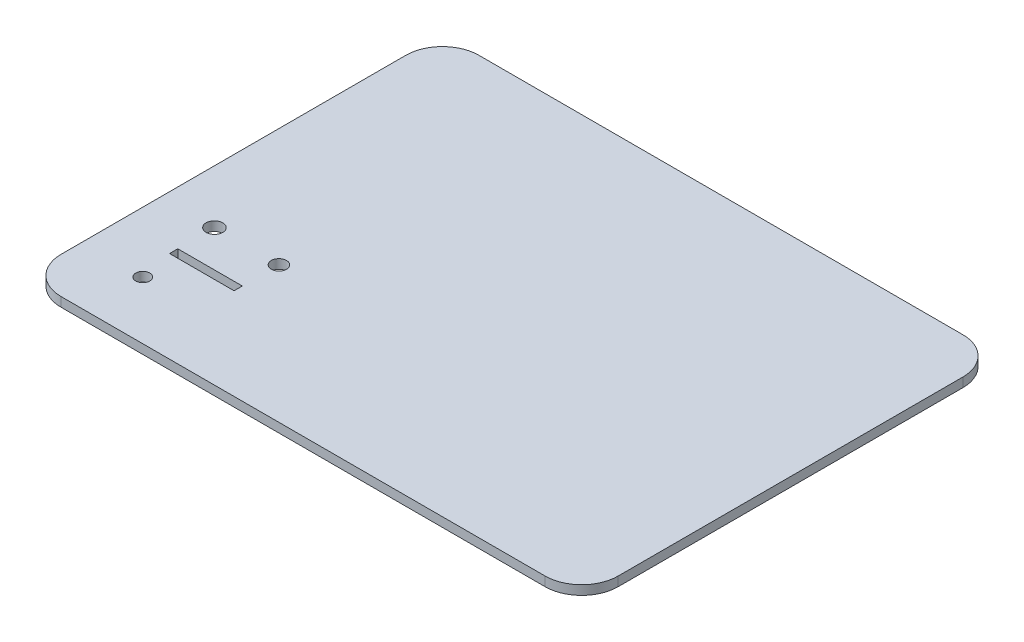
ISO-10303-21;
HEADER;
FILE_DESCRIPTION(('STEP AP214'),'2;1');
FILE_NAME('part.step','',(''),(''),'','','');
FILE_SCHEMA(('AUTOMOTIVE_DESIGN { 1 0 10303 214 1 1 1 1 }'));
ENDSEC;
DATA;
#1=APPLICATION_CONTEXT('core data for automotive mechanical design processes');
#2=APPLICATION_PROTOCOL_DEFINITION('international standard','automotive_design',2000,#1);
#3=PRODUCT_CONTEXT('',#1,'mechanical');
#4=PRODUCT('Part','Part','',(#3));
#5=PRODUCT_RELATED_PRODUCT_CATEGORY('part','',(#4));
#6=PRODUCT_DEFINITION_FORMATION('','',#4);
#7=PRODUCT_DEFINITION_CONTEXT('part definition',#1,'design');
#8=PRODUCT_DEFINITION('design','',#6,#7);
#9=PRODUCT_DEFINITION_SHAPE('','',#8);
#10=(LENGTH_UNIT() NAMED_UNIT(*) SI_UNIT(.MILLI.,.METRE.));
#11=(NAMED_UNIT(*) PLANE_ANGLE_UNIT() SI_UNIT($,.RADIAN.));
#12=(NAMED_UNIT(*) SI_UNIT($,.STERADIAN.) SOLID_ANGLE_UNIT());
#13=UNCERTAINTY_MEASURE_WITH_UNIT(LENGTH_MEASURE(1.E-05),#10,'distance_accuracy_value','');
#14=(GEOMETRIC_REPRESENTATION_CONTEXT(3) GLOBAL_UNCERTAINTY_ASSIGNED_CONTEXT((#13)) GLOBAL_UNIT_ASSIGNED_CONTEXT((#10,
#11,#12)) REPRESENTATION_CONTEXT('',''));
#15=CARTESIAN_POINT('',(0.,0.,0.));
#16=DIRECTION('',(0.,0.,1.));
#17=DIRECTION('',(1.,0.,0.));
#18=AXIS2_PLACEMENT_3D('',#15,#16,#17);
#19=CARTESIAN_POINT('',(10.,2.54,-104.3));
#20=DIRECTION('',(0.,-1.,0.));
#21=DIRECTION('',(0.,0.,-1.));
#22=AXIS2_PLACEMENT_3D('',#19,#20,#21);
#23=CYLINDRICAL_SURFACE('',#22,10.);
#24=CARTESIAN_POINT('',(10.,0.,-104.3));
#25=DIRECTION('',(0.,1.,0.));
#26=DIRECTION('',(0.,0.,-1.));
#27=AXIS2_PLACEMENT_3D('',#24,#25,#26);
#28=CIRCLE('',#27,10.);
#29=CARTESIAN_POINT('',(10.0000000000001,0.,-114.3));
#30=VERTEX_POINT('',#29);
#31=CARTESIAN_POINT('',(0.,0.,-104.3));
#32=VERTEX_POINT('',#31);
#33=EDGE_CURVE('E157',#30,#32,#28,.T.);
#34=ORIENTED_EDGE('',*,*,#33,.T.);
#35=DIRECTION('',(0.,-1.,0.));
#36=VECTOR('',#35,1.);
#37=CARTESIAN_POINT('',(0.,2.54,-104.3));
#38=LINE('',#37,#36);
#39=CARTESIAN_POINT('',(0.,2.54,-104.3));
#40=VERTEX_POINT('',#39);
#41=EDGE_CURVE('E11',#40,#32,#38,.T.);
#42=ORIENTED_EDGE('',*,*,#41,.F.);
#43=CARTESIAN_POINT('',(10.,2.54,-104.3));
#44=DIRECTION('',(0.,1.,0.));
#45=DIRECTION('',(0.,0.,-1.));
#46=AXIS2_PLACEMENT_3D('',#43,#44,#45);
#47=CIRCLE('',#46,10.);
#48=CARTESIAN_POINT('',(10.0000000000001,2.54,-114.3));
#49=VERTEX_POINT('',#48);
#50=EDGE_CURVE('E174',#49,#40,#47,.T.);
#51=ORIENTED_EDGE('',*,*,#50,.F.);
#52=DIRECTION('',(0.,-1.,0.));
#53=VECTOR('',#52,1.);
#54=CARTESIAN_POINT('',(10.0000000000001,2.54,-114.3));
#55=LINE('',#54,#53);
#56=EDGE_CURVE('E191',#49,#30,#55,.T.);
#57=ORIENTED_EDGE('',*,*,#56,.T.);
#58=EDGE_LOOP('',(#34,#42,#51,#57));
#59=FACE_BOUND('',#58,.T.);
#60=ADVANCED_FACE('F27',(#59),#23,.T.);
#61=CARTESIAN_POINT('',(0.,2.54,-10.0000000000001));
#62=DIRECTION('',(1.,0.,0.));
#63=DIRECTION('',(0.,0.,-1.));
#64=AXIS2_PLACEMENT_3D('',#61,#62,#63);
#65=PLANE('',#64);
#66=DIRECTION('',(0.,0.,1.));
#67=VECTOR('',#66,1.);
#68=CARTESIAN_POINT('',(0.,0.,-10.0000000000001));
#69=LINE('',#68,#67);
#70=CARTESIAN_POINT('',(0.,0.,-10.0000000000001));
#71=VERTEX_POINT('',#70);
#72=EDGE_CURVE('E160',#32,#71,#69,.T.);
#73=ORIENTED_EDGE('',*,*,#72,.T.);
#74=DIRECTION('',(0.,-1.,0.));
#75=VECTOR('',#74,1.);
#76=CARTESIAN_POINT('',(0.,2.54,-10.0000000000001));
#77=LINE('',#76,#75);
#78=CARTESIAN_POINT('',(0.,2.54,-10.0000000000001));
#79=VERTEX_POINT('',#78);
#80=EDGE_CURVE('E34',#79,#71,#77,.T.);
#81=ORIENTED_EDGE('',*,*,#80,.F.);
#82=DIRECTION('',(0.,0.,1.));
#83=VECTOR('',#82,1.);
#84=CARTESIAN_POINT('',(0.,2.54,-10.0000000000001));
#85=LINE('',#84,#83);
#86=EDGE_CURVE('E177',#40,#79,#85,.T.);
#87=ORIENTED_EDGE('',*,*,#86,.F.);
#88=ORIENTED_EDGE('',*,*,#41,.T.);
#89=EDGE_LOOP('',(#73,#81,#87,#88));
#90=FACE_BOUND('',#89,.T.);
#91=ADVANCED_FACE('F235',(#90),#65,.F.);
#92=CARTESIAN_POINT('',(10.,2.54,-10.));
#93=DIRECTION('',(0.,-1.,0.));
#94=DIRECTION('',(0.,0.,-1.));
#95=AXIS2_PLACEMENT_3D('',#92,#93,#94);
#96=CYLINDRICAL_SURFACE('',#95,10.);
#97=CARTESIAN_POINT('',(10.,0.,-10.));
#98=DIRECTION('',(0.,1.,0.));
#99=DIRECTION('',(0.,0.,-1.));
#100=AXIS2_PLACEMENT_3D('',#97,#98,#99);
#101=CIRCLE('',#100,10.);
#102=CARTESIAN_POINT('',(10.0000000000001,0.,0.));
#103=VERTEX_POINT('',#102);
#104=EDGE_CURVE('E162',#71,#103,#101,.T.);
#105=ORIENTED_EDGE('',*,*,#104,.T.);
#106=DIRECTION('',(0.,-1.,0.));
#107=VECTOR('',#106,1.);
#108=CARTESIAN_POINT('',(10.0000000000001,2.54,0.));
#109=LINE('',#108,#107);
#110=CARTESIAN_POINT('',(10.0000000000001,2.54,0.));
#111=VERTEX_POINT('',#110);
#112=EDGE_CURVE('E206',#111,#103,#109,.T.);
#113=ORIENTED_EDGE('',*,*,#112,.F.);
#114=CARTESIAN_POINT('',(10.,2.54,-10.));
#115=DIRECTION('',(0.,1.,0.));
#116=DIRECTION('',(0.,0.,-1.));
#117=AXIS2_PLACEMENT_3D('',#114,#115,#116);
#118=CIRCLE('',#117,10.);
#119=EDGE_CURVE('E179',#79,#111,#118,.T.);
#120=ORIENTED_EDGE('',*,*,#119,.F.);
#121=ORIENTED_EDGE('',*,*,#80,.T.);
#122=EDGE_LOOP('',(#105,#113,#120,#121));
#123=FACE_BOUND('',#122,.T.);
#124=ADVANCED_FACE('F213',(#123),#96,.T.);
#125=CARTESIAN_POINT('',(10.0000000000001,2.54,0.));
#126=DIRECTION('',(0.,0.,-1.));
#127=DIRECTION('',(-1.,0.,0.));
#128=AXIS2_PLACEMENT_3D('',#125,#126,#127);
#129=PLANE('',#128);
#130=DIRECTION('',(1.,0.,0.));
#131=VECTOR('',#130,1.);
#132=CARTESIAN_POINT('',(10.0000000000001,0.,0.));
#133=LINE('',#132,#131);
#134=CARTESIAN_POINT('',(142.4,0.,0.));
#135=VERTEX_POINT('',#134);
#136=EDGE_CURVE('E164',#103,#135,#133,.T.);
#137=ORIENTED_EDGE('',*,*,#136,.T.);
#138=DIRECTION('',(0.,-1.,0.));
#139=VECTOR('',#138,1.);
#140=CARTESIAN_POINT('',(142.4,2.54,0.));
#141=LINE('',#140,#139);
#142=CARTESIAN_POINT('',(142.4,2.54,0.));
#143=VERTEX_POINT('',#142);
#144=EDGE_CURVE('E203',#143,#135,#141,.T.);
#145=ORIENTED_EDGE('',*,*,#144,.F.);
#146=DIRECTION('',(1.,0.,0.));
#147=VECTOR('',#146,1.);
#148=CARTESIAN_POINT('',(10.0000000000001,2.54,0.));
#149=LINE('',#148,#147);
#150=EDGE_CURVE('E181',#111,#143,#149,.T.);
#151=ORIENTED_EDGE('',*,*,#150,.F.);
#152=ORIENTED_EDGE('',*,*,#112,.T.);
#153=EDGE_LOOP('',(#137,#145,#151,#152));
#154=FACE_BOUND('',#153,.T.);
#155=ADVANCED_FACE('F224',(#154),#129,.F.);
#156=CARTESIAN_POINT('',(142.4,2.54,-10.));
#157=DIRECTION('',(0.,-1.,0.));
#158=DIRECTION('',(0.,0.,-1.));
#159=AXIS2_PLACEMENT_3D('',#156,#157,#158);
#160=CYLINDRICAL_SURFACE('',#159,10.);
#161=CARTESIAN_POINT('',(142.4,0.,-10.));
#162=DIRECTION('',(0.,1.,0.));
#163=DIRECTION('',(0.,0.,-1.));
#164=AXIS2_PLACEMENT_3D('',#161,#162,#163);
#165=CIRCLE('',#164,10.);
#166=CARTESIAN_POINT('',(152.4,0.,-10.0000000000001));
#167=VERTEX_POINT('',#166);
#168=EDGE_CURVE('E166',#135,#167,#165,.T.);
#169=ORIENTED_EDGE('',*,*,#168,.T.);
#170=DIRECTION('',(0.,-1.,0.));
#171=VECTOR('',#170,1.);
#172=CARTESIAN_POINT('',(152.4,2.54,-10.0000000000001));
#173=LINE('',#172,#171);
#174=CARTESIAN_POINT('',(152.4,2.54,-10.0000000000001));
#175=VERTEX_POINT('',#174);
#176=EDGE_CURVE('E200',#175,#167,#173,.T.);
#177=ORIENTED_EDGE('',*,*,#176,.F.);
#178=CARTESIAN_POINT('',(142.4,2.54,-10.));
#179=DIRECTION('',(0.,1.,0.));
#180=DIRECTION('',(0.,0.,-1.));
#181=AXIS2_PLACEMENT_3D('',#178,#179,#180);
#182=CIRCLE('',#181,10.);
#183=EDGE_CURVE('E183',#143,#175,#182,.T.);
#184=ORIENTED_EDGE('',*,*,#183,.F.);
#185=ORIENTED_EDGE('',*,*,#144,.T.);
#186=EDGE_LOOP('',(#169,#177,#184,#185));
#187=FACE_BOUND('',#186,.T.);
#188=ADVANCED_FACE('F228',(#187),#160,.T.);
#189=CARTESIAN_POINT('',(152.4,2.54,-10.0000000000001));
#190=DIRECTION('',(-1.,0.,0.));
#191=DIRECTION('',(0.,0.,1.));
#192=AXIS2_PLACEMENT_3D('',#189,#190,#191);
#193=PLANE('',#192);
#194=DIRECTION('',(0.,0.,-1.));
#195=VECTOR('',#194,1.);
#196=CARTESIAN_POINT('',(152.4,0.,-10.0000000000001));
#197=LINE('',#196,#195);
#198=CARTESIAN_POINT('',(152.4,0.,-104.3));
#199=VERTEX_POINT('',#198);
#200=EDGE_CURVE('E168',#167,#199,#197,.T.);
#201=ORIENTED_EDGE('',*,*,#200,.T.);
#202=DIRECTION('',(0.,-1.,0.));
#203=VECTOR('',#202,1.);
#204=CARTESIAN_POINT('',(152.4,2.54,-104.3));
#205=LINE('',#204,#203);
#206=CARTESIAN_POINT('',(152.4,2.54,-104.3));
#207=VERTEX_POINT('',#206);
#208=EDGE_CURVE('E197',#207,#199,#205,.T.);
#209=ORIENTED_EDGE('',*,*,#208,.F.);
#210=DIRECTION('',(0.,0.,-1.));
#211=VECTOR('',#210,1.);
#212=CARTESIAN_POINT('',(152.4,2.54,-10.0000000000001));
#213=LINE('',#212,#211);
#214=EDGE_CURVE('E185',#175,#207,#213,.T.);
#215=ORIENTED_EDGE('',*,*,#214,.F.);
#216=ORIENTED_EDGE('',*,*,#176,.T.);
#217=EDGE_LOOP('',(#201,#209,#215,#216));
#218=FACE_BOUND('',#217,.T.);
#219=ADVANCED_FACE('F248',(#218),#193,.F.);
#220=CARTESIAN_POINT('',(142.4,2.54,-104.3));
#221=DIRECTION('',(0.,-1.,0.));
#222=DIRECTION('',(0.,0.,-1.));
#223=AXIS2_PLACEMENT_3D('',#220,#221,#222);
#224=CYLINDRICAL_SURFACE('',#223,10.);
#225=CARTESIAN_POINT('',(142.4,0.,-104.3));
#226=DIRECTION('',(0.,1.,0.));
#227=DIRECTION('',(0.,0.,-1.));
#228=AXIS2_PLACEMENT_3D('',#225,#226,#227);
#229=CIRCLE('',#228,10.);
#230=CARTESIAN_POINT('',(142.4,0.,-114.3));
#231=VERTEX_POINT('',#230);
#232=EDGE_CURVE('E170',#199,#231,#229,.T.);
#233=ORIENTED_EDGE('',*,*,#232,.T.);
#234=DIRECTION('',(0.,-1.,0.));
#235=VECTOR('',#234,1.);
#236=CARTESIAN_POINT('',(142.4,2.54,-114.3));
#237=LINE('',#236,#235);
#238=CARTESIAN_POINT('',(142.4,2.54,-114.3));
#239=VERTEX_POINT('',#238);
#240=EDGE_CURVE('E194',#239,#231,#237,.T.);
#241=ORIENTED_EDGE('',*,*,#240,.F.);
#242=CARTESIAN_POINT('',(142.4,2.54,-104.3));
#243=DIRECTION('',(0.,1.,0.));
#244=DIRECTION('',(0.,0.,-1.));
#245=AXIS2_PLACEMENT_3D('',#242,#243,#244);
#246=CIRCLE('',#245,10.);
#247=EDGE_CURVE('E187',#207,#239,#246,.T.);
#248=ORIENTED_EDGE('',*,*,#247,.F.);
#249=ORIENTED_EDGE('',*,*,#208,.T.);
#250=EDGE_LOOP('',(#233,#241,#248,#249));
#251=FACE_BOUND('',#250,.T.);
#252=ADVANCED_FACE('F246',(#251),#224,.T.);
#253=CARTESIAN_POINT('',(10.0000000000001,2.54,-114.3));
#254=DIRECTION('',(0.,0.,1.));
#255=DIRECTION('',(1.,0.,0.));
#256=AXIS2_PLACEMENT_3D('',#253,#254,#255);
#257=PLANE('',#256);
#258=DIRECTION('',(-1.,0.,0.));
#259=VECTOR('',#258,1.);
#260=CARTESIAN_POINT('',(10.0000000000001,0.,-114.3));
#261=LINE('',#260,#259);
#262=EDGE_CURVE('E172',#231,#30,#261,.T.);
#263=ORIENTED_EDGE('',*,*,#262,.T.);
#264=ORIENTED_EDGE('',*,*,#56,.F.);
#265=DIRECTION('',(-1.,0.,0.));
#266=VECTOR('',#265,1.);
#267=CARTESIAN_POINT('',(10.0000000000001,2.54,-114.3));
#268=LINE('',#267,#266);
#269=EDGE_CURVE('E189',#239,#49,#268,.T.);
#270=ORIENTED_EDGE('',*,*,#269,.F.);
#271=ORIENTED_EDGE('',*,*,#240,.T.);
#272=EDGE_LOOP('',(#263,#264,#270,#271));
#273=FACE_BOUND('',#272,.T.);
#274=ADVANCED_FACE('F241',(#273),#257,.F.);
#275=CARTESIAN_POINT('',(10.,2.54,-104.3));
#276=DIRECTION('',(0.,-1.,0.));
#277=DIRECTION('',(0.,0.,-1.));
#278=AXIS2_PLACEMENT_3D('',#275,#276,#277);
#279=PLANE('',#278);
#280=CARTESIAN_POINT('',(14.6510144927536,2.54,-37.3051563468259));
#281=DIRECTION('',(0.,1.,0.));
#282=DIRECTION('',(0.,0.,1.));
#283=AXIS2_PLACEMENT_3D('',#280,#281,#282);
#284=CIRCLE('',#283,2.28049267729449);
#285=CARTESIAN_POINT('',(14.6510144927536,2.54,-35.0246636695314));
#286=VERTEX_POINT('',#285);
#287=EDGE_CURVE('E360',#286,#286,#284,.T.);
#288=ORIENTED_EDGE('',*,*,#287,.F.);
#289=EDGE_LOOP('',(#288));
#290=FACE_BOUND('',#289,.T.);
#291=CARTESIAN_POINT('',(32.2918572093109,2.54,-37.3051563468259));
#292=DIRECTION('',(0.,1.,0.));
#293=DIRECTION('',(0.,0.,1.));
#294=AXIS2_PLACEMENT_3D('',#291,#292,#293);
#295=CIRCLE('',#294,2.08718161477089);
#296=CARTESIAN_POINT('',(32.2918572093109,2.54,-35.217974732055));
#297=VERTEX_POINT('',#296);
#298=EDGE_CURVE('E362',#297,#297,#295,.T.);
#299=ORIENTED_EDGE('',*,*,#298,.F.);
#300=EDGE_LOOP('',(#299));
#301=FACE_BOUND('',#300,.T.);
#302=DIRECTION('',(1.,0.,0.));
#303=VECTOR('',#302,1.);
#304=CARTESIAN_POINT('',(14.6510144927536,2.54,-25.0293813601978));
#305=LINE('',#304,#303);
#306=CARTESIAN_POINT('',(14.6510144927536,2.54,-25.0293813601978));
#307=VERTEX_POINT('',#306);
#308=CARTESIAN_POINT('',(32.2918572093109,2.54,-25.0293813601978));
#309=VERTEX_POINT('',#308);
#310=EDGE_CURVE('E126',#307,#309,#305,.T.);
#311=ORIENTED_EDGE('',*,*,#310,.F.);
#312=DIRECTION('',(0.,0.,1.));
#313=VECTOR('',#312,1.);
#314=CARTESIAN_POINT('',(14.6510144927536,2.54,-25.0293813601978));
#315=LINE('',#314,#313);
#316=CARTESIAN_POINT('',(14.6510144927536,2.54,-27.2825929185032));
#317=VERTEX_POINT('',#316);
#318=EDGE_CURVE('E41',#317,#307,#315,.T.);
#319=ORIENTED_EDGE('',*,*,#318,.F.);
#320=DIRECTION('',(-1.,0.,0.));
#321=VECTOR('',#320,1.);
#322=CARTESIAN_POINT('',(14.6510144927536,2.54,-27.2825929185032));
#323=LINE('',#322,#321);
#324=CARTESIAN_POINT('',(32.2918572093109,2.54,-27.2825929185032));
#325=VERTEX_POINT('',#324);
#326=EDGE_CURVE('E133',#325,#317,#323,.T.);
#327=ORIENTED_EDGE('',*,*,#326,.F.);
#328=DIRECTION('',(0.,0.,-1.));
#329=VECTOR('',#328,1.);
#330=CARTESIAN_POINT('',(32.2918572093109,2.54,-25.0293813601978));
#331=LINE('',#330,#329);
#332=EDGE_CURVE('E117',#309,#325,#331,.T.);
#333=ORIENTED_EDGE('',*,*,#332,.F.);
#334=EDGE_LOOP('',(#311,#319,#327,#333));
#335=FACE_BOUND('',#334,.T.);
#336=CARTESIAN_POINT('',(16.5565558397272,2.54,-15.7997527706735));
#337=DIRECTION('',(0.,1.,0.));
#338=DIRECTION('',(0.,0.,1.));
#339=AXIS2_PLACEMENT_3D('',#336,#337,#338);
#340=CIRCLE('',#339,1.90554134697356);
#341=CARTESIAN_POINT('',(16.5565558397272,2.54,-13.8942114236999));
#342=VERTEX_POINT('',#341);
#343=EDGE_CURVE('E149',#342,#342,#340,.T.);
#344=ORIENTED_EDGE('',*,*,#343,.F.);
#345=EDGE_LOOP('',(#344));
#346=FACE_BOUND('',#345,.T.);
#347=ORIENTED_EDGE('',*,*,#50,.T.);
#348=ORIENTED_EDGE('',*,*,#86,.T.);
#349=ORIENTED_EDGE('',*,*,#119,.T.);
#350=ORIENTED_EDGE('',*,*,#150,.T.);
#351=ORIENTED_EDGE('',*,*,#183,.T.);
#352=ORIENTED_EDGE('',*,*,#214,.T.);
#353=ORIENTED_EDGE('',*,*,#247,.T.);
#354=ORIENTED_EDGE('',*,*,#269,.T.);
#355=EDGE_LOOP('',(#347,#348,#349,#350,#351,#352,#353,#354));
#356=FACE_BOUND('',#355,.T.);
#357=ADVANCED_FACE('F130',(#290,#301,#335,#346,#356),#279,.F.);
#358=CARTESIAN_POINT('',(10.,0.,-104.3));
#359=DIRECTION('',(0.,-1.,0.));
#360=DIRECTION('',(0.,0.,-1.));
#361=AXIS2_PLACEMENT_3D('',#358,#359,#360);
#362=PLANE('',#361);
#363=CARTESIAN_POINT('',(14.6510144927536,0.,-37.3051563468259));
#364=DIRECTION('',(0.,1.,0.));
#365=DIRECTION('',(0.,0.,1.));
#366=AXIS2_PLACEMENT_3D('',#363,#364,#365);
#367=CIRCLE('',#366,2.28049267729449);
#368=CARTESIAN_POINT('',(14.6510144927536,0.,-35.0246636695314));
#369=VERTEX_POINT('',#368);
#370=EDGE_CURVE('E357',#369,#369,#367,.T.);
#371=ORIENTED_EDGE('',*,*,#370,.T.);
#372=EDGE_LOOP('',(#371));
#373=FACE_BOUND('',#372,.T.);
#374=CARTESIAN_POINT('',(32.2918572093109,0.,-37.3051563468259));
#375=DIRECTION('',(0.,1.,0.));
#376=DIRECTION('',(0.,0.,1.));
#377=AXIS2_PLACEMENT_3D('',#374,#375,#376);
#378=CIRCLE('',#377,2.08718161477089);
#379=CARTESIAN_POINT('',(32.2918572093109,0.,-35.217974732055));
#380=VERTEX_POINT('',#379);
#381=EDGE_CURVE('E367',#380,#380,#378,.T.);
#382=ORIENTED_EDGE('',*,*,#381,.T.);
#383=EDGE_LOOP('',(#382));
#384=FACE_BOUND('',#383,.T.);
#385=DIRECTION('',(0.,0.,1.));
#386=VECTOR('',#385,1.);
#387=CARTESIAN_POINT('',(14.6510144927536,0.,-25.0293813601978));
#388=LINE('',#387,#386);
#389=CARTESIAN_POINT('',(14.6510144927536,0.,-27.2825929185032));
#390=VERTEX_POINT('',#389);
#391=CARTESIAN_POINT('',(14.6510144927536,0.,-25.0293813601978));
#392=VERTEX_POINT('',#391);
#393=EDGE_CURVE('E135',#390,#392,#388,.T.);
#394=ORIENTED_EDGE('',*,*,#393,.T.);
#395=DIRECTION('',(1.,0.,0.));
#396=VECTOR('',#395,1.);
#397=CARTESIAN_POINT('',(14.6510144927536,0.,-25.0293813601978));
#398=LINE('',#397,#396);
#399=CARTESIAN_POINT('',(32.2918572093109,0.,-25.0293813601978));
#400=VERTEX_POINT('',#399);
#401=EDGE_CURVE('E141',#392,#400,#398,.T.);
#402=ORIENTED_EDGE('',*,*,#401,.T.);
#403=DIRECTION('',(0.,0.,-1.));
#404=VECTOR('',#403,1.);
#405=CARTESIAN_POINT('',(32.2918572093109,0.,-25.0293813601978));
#406=LINE('',#405,#404);
#407=CARTESIAN_POINT('',(32.2918572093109,0.,-27.2825929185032));
#408=VERTEX_POINT('',#407);
#409=EDGE_CURVE('E49',#400,#408,#406,.T.);
#410=ORIENTED_EDGE('',*,*,#409,.T.);
#411=DIRECTION('',(-1.,0.,0.));
#412=VECTOR('',#411,1.);
#413=CARTESIAN_POINT('',(14.6510144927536,0.,-27.2825929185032));
#414=LINE('',#413,#412);
#415=EDGE_CURVE('E144',#408,#390,#414,.T.);
#416=ORIENTED_EDGE('',*,*,#415,.T.);
#417=EDGE_LOOP('',(#394,#402,#410,#416));
#418=FACE_BOUND('',#417,.T.);
#419=CARTESIAN_POINT('',(16.5565558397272,0.,-15.7997527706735));
#420=DIRECTION('',(0.,1.,0.));
#421=DIRECTION('',(0.,0.,1.));
#422=AXIS2_PLACEMENT_3D('',#419,#420,#421);
#423=CIRCLE('',#422,1.90554134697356);
#424=CARTESIAN_POINT('',(16.5565558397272,0.,-13.8942114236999));
#425=VERTEX_POINT('',#424);
#426=EDGE_CURVE('E154',#425,#425,#423,.T.);
#427=ORIENTED_EDGE('',*,*,#426,.T.);
#428=EDGE_LOOP('',(#427));
#429=FACE_BOUND('',#428,.T.);
#430=ORIENTED_EDGE('',*,*,#33,.F.);
#431=ORIENTED_EDGE('',*,*,#262,.F.);
#432=ORIENTED_EDGE('',*,*,#232,.F.);
#433=ORIENTED_EDGE('',*,*,#200,.F.);
#434=ORIENTED_EDGE('',*,*,#168,.F.);
#435=ORIENTED_EDGE('',*,*,#136,.F.);
#436=ORIENTED_EDGE('',*,*,#104,.F.);
#437=ORIENTED_EDGE('',*,*,#72,.F.);
#438=EDGE_LOOP('',(#430,#431,#432,#433,#434,#435,#436,#437));
#439=FACE_BOUND('',#438,.T.);
#440=ADVANCED_FACE('F219',(#373,#384,#418,#429,#439),#362,.T.);
#441=CARTESIAN_POINT('',(16.5565558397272,0.,-15.7997527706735));
#442=DIRECTION('',(0.,1.,0.));
#443=DIRECTION('',(0.,0.,1.));
#444=AXIS2_PLACEMENT_3D('',#441,#442,#443);
#445=CYLINDRICAL_SURFACE('',#444,1.90554134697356);
#446=ORIENTED_EDGE('',*,*,#426,.F.);
#447=EDGE_LOOP('',(#446));
#448=FACE_BOUND('',#447,.T.);
#449=ORIENTED_EDGE('',*,*,#343,.T.);
#450=EDGE_LOOP('',(#449));
#451=FACE_BOUND('',#450,.T.);
#452=ADVANCED_FACE('F301',(#448,#451),#445,.F.);
#453=CARTESIAN_POINT('',(14.6510144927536,0.,-25.0293813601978));
#454=DIRECTION('',(-1.,0.,0.));
#455=DIRECTION('',(0.,0.,1.));
#456=AXIS2_PLACEMENT_3D('',#453,#454,#455);
#457=PLANE('',#456);
#458=ORIENTED_EDGE('',*,*,#318,.T.);
#459=DIRECTION('',(0.,1.,0.));
#460=VECTOR('',#459,1.);
#461=CARTESIAN_POINT('',(14.6510144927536,0.,-25.0293813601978));
#462=LINE('',#461,#460);
#463=EDGE_CURVE('E123',#392,#307,#462,.T.);
#464=ORIENTED_EDGE('',*,*,#463,.F.);
#465=ORIENTED_EDGE('',*,*,#393,.F.);
#466=DIRECTION('',(0.,1.,0.));
#467=VECTOR('',#466,1.);
#468=CARTESIAN_POINT('',(14.6510144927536,0.,-27.2825929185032));
#469=LINE('',#468,#467);
#470=EDGE_CURVE('E147',#390,#317,#469,.T.);
#471=ORIENTED_EDGE('',*,*,#470,.T.);
#472=EDGE_LOOP('',(#458,#464,#465,#471));
#473=FACE_BOUND('',#472,.T.);
#474=ADVANCED_FACE('F309',(#473),#457,.F.);
#475=CARTESIAN_POINT('',(14.6510144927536,0.,-27.2825929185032));
#476=DIRECTION('',(0.,0.,-1.));
#477=DIRECTION('',(-1.,0.,0.));
#478=AXIS2_PLACEMENT_3D('',#475,#476,#477);
#479=PLANE('',#478);
#480=ORIENTED_EDGE('',*,*,#326,.T.);
#481=ORIENTED_EDGE('',*,*,#470,.F.);
#482=ORIENTED_EDGE('',*,*,#415,.F.);
#483=DIRECTION('',(0.,1.,0.));
#484=VECTOR('',#483,1.);
#485=CARTESIAN_POINT('',(32.2918572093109,0.,-27.2825929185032));
#486=LINE('',#485,#484);
#487=EDGE_CURVE('E122',#408,#325,#486,.T.);
#488=ORIENTED_EDGE('',*,*,#487,.T.);
#489=EDGE_LOOP('',(#480,#481,#482,#488));
#490=FACE_BOUND('',#489,.T.);
#491=ADVANCED_FACE('F317',(#490),#479,.F.);
#492=CARTESIAN_POINT('',(32.2918572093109,0.,-25.0293813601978));
#493=DIRECTION('',(1.,0.,0.));
#494=DIRECTION('',(0.,0.,-1.));
#495=AXIS2_PLACEMENT_3D('',#492,#493,#494);
#496=PLANE('',#495);
#497=ORIENTED_EDGE('',*,*,#332,.T.);
#498=ORIENTED_EDGE('',*,*,#487,.F.);
#499=ORIENTED_EDGE('',*,*,#409,.F.);
#500=DIRECTION('',(0.,1.,0.));
#501=VECTOR('',#500,1.);
#502=CARTESIAN_POINT('',(32.2918572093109,0.,-25.0293813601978));
#503=LINE('',#502,#501);
#504=EDGE_CURVE('E113',#400,#309,#503,.T.);
#505=ORIENTED_EDGE('',*,*,#504,.T.);
#506=EDGE_LOOP('',(#497,#498,#499,#505));
#507=FACE_BOUND('',#506,.T.);
#508=ADVANCED_FACE('F115',(#507),#496,.F.);
#509=CARTESIAN_POINT('',(14.6510144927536,0.,-25.0293813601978));
#510=DIRECTION('',(0.,0.,1.));
#511=DIRECTION('',(1.,0.,0.));
#512=AXIS2_PLACEMENT_3D('',#509,#510,#511);
#513=PLANE('',#512);
#514=ORIENTED_EDGE('',*,*,#310,.T.);
#515=ORIENTED_EDGE('',*,*,#504,.F.);
#516=ORIENTED_EDGE('',*,*,#401,.F.);
#517=ORIENTED_EDGE('',*,*,#463,.T.);
#518=EDGE_LOOP('',(#514,#515,#516,#517));
#519=FACE_BOUND('',#518,.T.);
#520=ADVANCED_FACE('F127',(#519),#513,.F.);
#521=CARTESIAN_POINT('',(32.2918572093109,0.,-37.3051563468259));
#522=DIRECTION('',(0.,1.,0.));
#523=DIRECTION('',(0.,0.,1.));
#524=AXIS2_PLACEMENT_3D('',#521,#522,#523);
#525=CYLINDRICAL_SURFACE('',#524,2.08718161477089);
#526=ORIENTED_EDGE('',*,*,#381,.F.);
#527=EDGE_LOOP('',(#526));
#528=FACE_BOUND('',#527,.T.);
#529=ORIENTED_EDGE('',*,*,#298,.T.);
#530=EDGE_LOOP('',(#529));
#531=FACE_BOUND('',#530,.T.);
#532=ADVANCED_FACE('F337',(#528,#531),#525,.F.);
#533=CARTESIAN_POINT('',(14.6510144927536,0.,-37.3051563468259));
#534=DIRECTION('',(0.,1.,0.));
#535=DIRECTION('',(0.,0.,1.));
#536=AXIS2_PLACEMENT_3D('',#533,#534,#535);
#537=CYLINDRICAL_SURFACE('',#536,2.28049267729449);
#538=ORIENTED_EDGE('',*,*,#370,.F.);
#539=EDGE_LOOP('',(#538));
#540=FACE_BOUND('',#539,.T.);
#541=ORIENTED_EDGE('',*,*,#287,.T.);
#542=EDGE_LOOP('',(#541));
#543=FACE_BOUND('',#542,.T.);
#544=ADVANCED_FACE('F344',(#540,#543),#537,.F.);
#545=CLOSED_SHELL('',(#60,#91,#124,#155,#188,#219,#252,#274,#357,#440,#452,#474,#491,#508,#520,
#532,#544));
#546=MANIFOLD_SOLID_BREP('B2',#545);
#547=ADVANCED_BREP_SHAPE_REPRESENTATION('',(#18,#546),#14);
#548=SHAPE_DEFINITION_REPRESENTATION(#9,#547);
ENDSEC;
END-ISO-10303-21;
